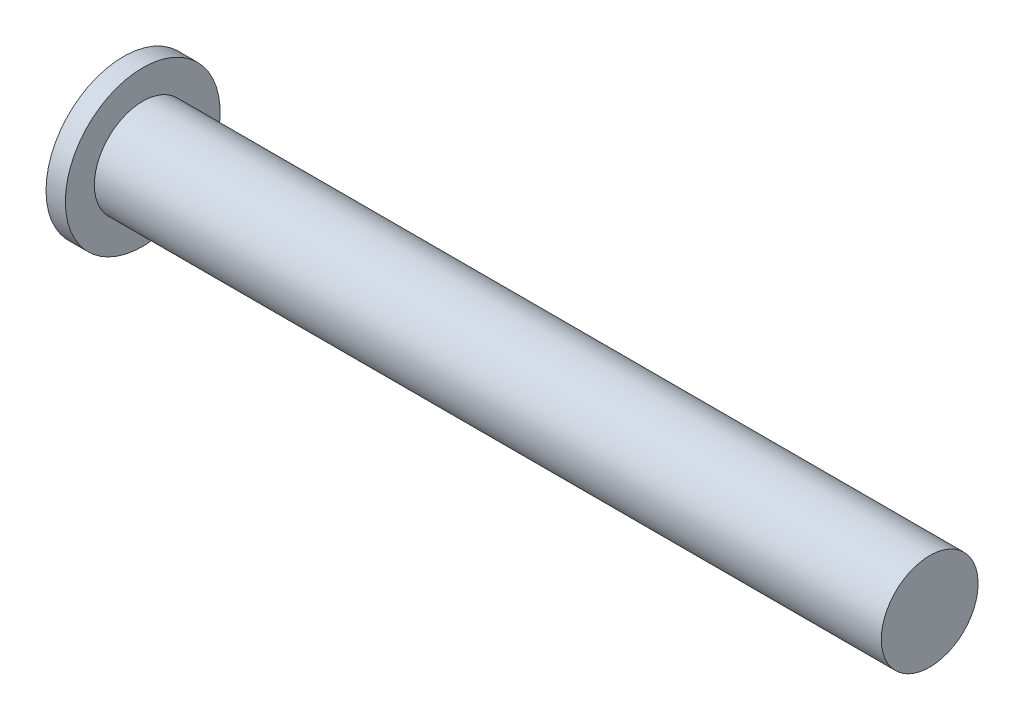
from build123d import *


with BuildPart() as part:
    # Sketch1 → Revolve1 (revolve)
    with BuildSketch(Plane.XY, mode=Mode.PRIVATE) as revolve1_sk:
        Polygon((0, 0), (0, 4.8768), (1.2192, 4.8768), (1.2192, 3.048), (50.8, 3.048), (50.8, 0), align=None)
    revolve(revolve1_sk.sketch.rotate(Axis((50.8, 0, 0), (-1, 0, 0)), 270), axis=Axis((50.8, 0, 0), (-1, 0, 0)))


solid = part.part
